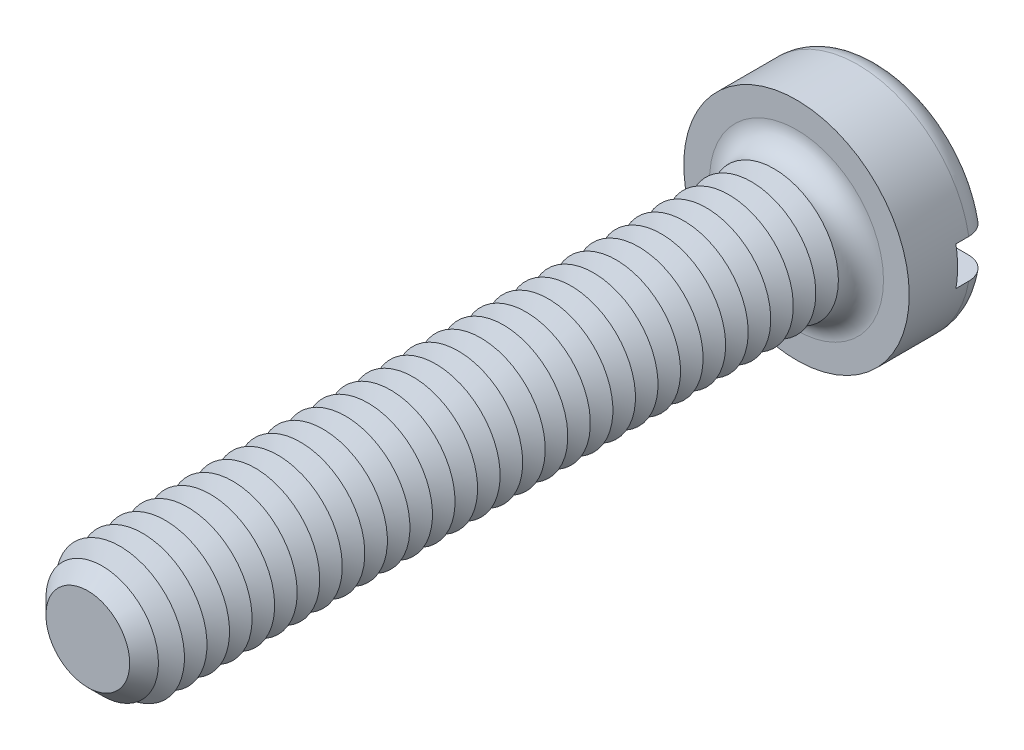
from build123d import *

# Parameters (mm, degrees)
SKETCH3_R           = 3.5
BOSS_EXTRUDE2_DEPTH = 2.6
SKETCH4_R           = 2
BOSS_EXTRUDE3_DEPTH = 22
FILLET1_R           = 0.7
CHAMFER1_SIZE       = 0.7
LPATTERN1_COUNT     = 30
LPATTERN1_PITCH     = 0.7
SKETCH8_W           = 7
SKETCH8_H           = 1.2
CUT_EXTRUDE1_DEPTH  = 1.1


with BuildPart() as part:
    # Sketch3 → Boss-Extrude2 (new body)
    with BuildSketch(Plane.XY):
        Circle(SKETCH3_R)
    extrude(amount=-BOSS_EXTRUDE2_DEPTH)

    # Sketch4 → Boss-Extrude3 (add)
    with BuildSketch(Plane.XY):
        Circle(SKETCH4_R)
    extrude(amount=BOSS_EXTRUDE3_DEPTH)

    # Fillet1
    fillet1_edges = [part.edges().sort_by_distance(p)[0] for p in [
        (-3.5, 0, -2.6),
        (-2, 0, 0),
    ]]
    fillet(fillet1_edges, radius=FILLET1_R)

    # Chamfer1
    chamfer1_edges = [part.edges().sort_by_distance(p)[0] for p in [
        (-2, 0, 22),
    ]]
    chamfer(chamfer1_edges, length=CHAMFER1_SIZE)

    # Sketch6 → Cut-Revolve1 (revolve, cut)
    with BuildSketch(Plane(origin=(0, 0, 0), x_dir=(0, 0, -1), z_dir=(1, 0, 0)), mode=Mode.PRIVATE) as cut_revolve1_sk:
        Polygon((-0.7, 2), (-1.05, 1.393782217), (-1.4, 2), align=None)
    cut_revolve1 = revolve(cut_revolve1_sk.sketch.rotate(Axis((0, 0, -1.694361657), (0, 0, 1)), 90), axis=Axis((0, 0, -1.694361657), (0, 0, 1)), mode=Mode.SUBTRACT)

    # LPattern1: Cut-Revolve1 ×30
    with Locations(*[(0, 0, i * LPATTERN1_PITCH) for i in range(1, LPATTERN1_COUNT)]):
        add(cut_revolve1, mode=Mode.SUBTRACT)

    # Sketch8 → Cut-Extrude1 (cut)
    with BuildSketch(Plane(origin=(0, 0, -2.6), x_dir=(-1, 0, 0), z_dir=(0, 0, -1))):
        Rectangle(SKETCH8_W, SKETCH8_H)
    extrude(amount=-CUT_EXTRUDE1_DEPTH, mode=Mode.SUBTRACT)


solid = part.part
